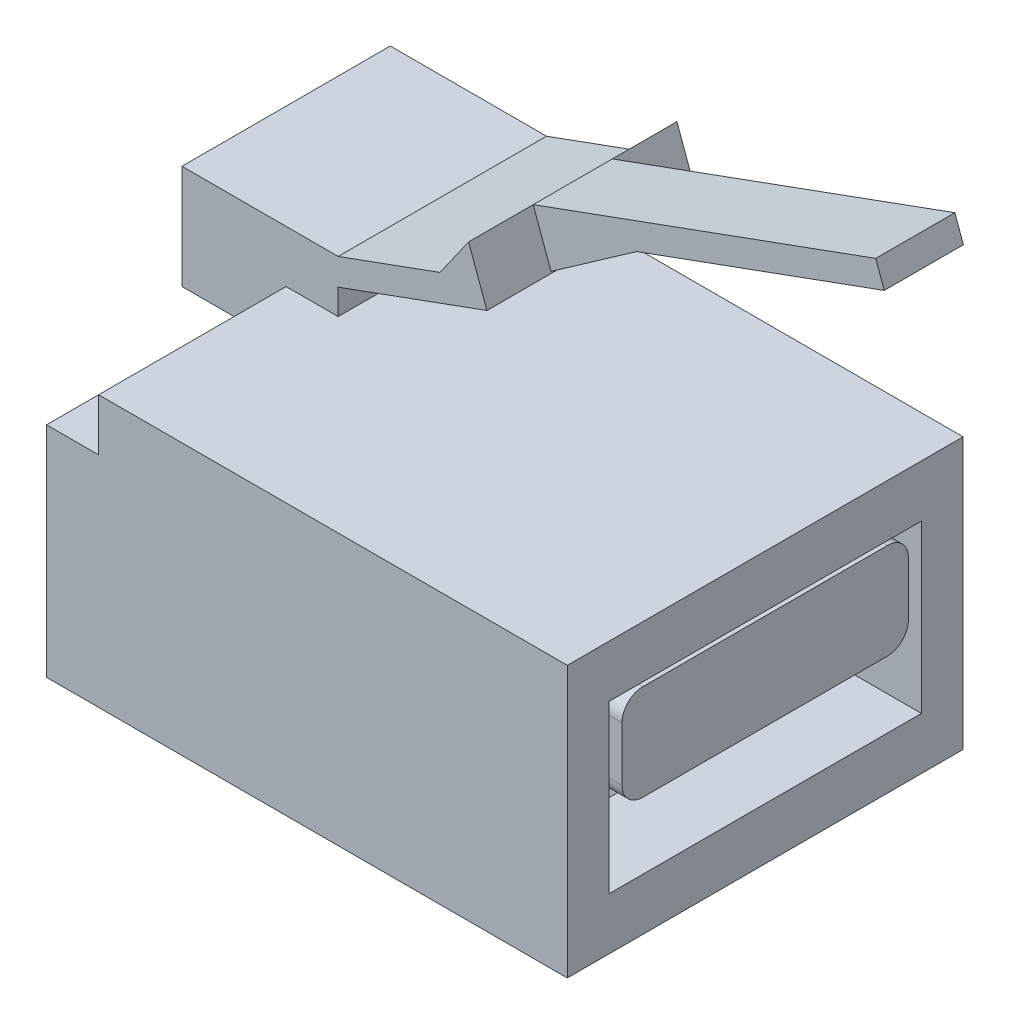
from build123d import *
from build123d.topology import SkipClean

# Parameters (mm, degrees)
SKETCH1_W           = 9.5
SKETCH1_H           = 6.5
EXTRUDE1_DEPTH      = 12.5
EXTRUDE2_DEPTH      = 1.25
EXTRUDE2_DEPTH_BACK = 2.5
SKETCH2_W           = 5
SKETCH2_H           = 2.5
CUT_EXTRUDE1_DEPTH  = 1.25
SKETCH4_W           = 4.5
SKETCH4_H           = 1.25
CUT_EXTRUDE3_DEPTH  = 1.25
CUT_EXTRUDE4_DEPTH  = 3.75
SKETCH8_W           = 7.5
SKETCH8_H           = 4
CUT_EXTRUDE5_DEPTH  = 6.25
EXTRUDE3_DEPTH      = 6.25
EXTRUDE4_DEPTH      = 6.25
SKETCH15_R          = 0.420384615
CUT_EXTRUDE7_DEPTH  = 5.968232
SKETCH18_W          = 4.317612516
SKETCH18_H          = 3.271423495
CUT_EXTRUDE9_DEPTH  = 5.288462
EXTRUDE7_DEPTH      = 0.460769
EXTRUDE7_DEPTH_BACK = 4.787692
EXTRUDE12_DEPTH     = 5
SKETCH25_W          = 1.9
SKETCH25_H          = 0.6
EXTRUDE13_DEPTH     = 8.75
CHAMFER4_SIZE       = 0.65
CHAMFER4_SIZE2      = 2.425833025


with BuildPart() as part:
    # Sketch1 → Extrude1 (new body)
    with BuildSketch(Plane(origin=(0, 0, 0), x_dir=(0, 0, -1), z_dir=(1, 0, 0))):
        with Locations((4.75, 3.25)):
            Rectangle(SKETCH1_W, SKETCH1_H)
    extrude(amount=EXTRUDE1_DEPTH)

    # Sketch2 → Extrude2 (add, two sides: drawn at the far end of the back side and taken through both)
    with BuildSketch(Plane.ZY.offset(-EXTRUDE2_DEPTH_BACK)):
        with Locations((-7, 6.5)):
            Rectangle(SKETCH2_W, SKETCH2_H)
    extrude(amount=EXTRUDE2_DEPTH + EXTRUDE2_DEPTH_BACK)

    # Sketch3 → Cut-Extrude1 (cut)
    with BuildSketch(Plane.ZY):
        Polygon((-7.394230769, 0), (-7.394230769, 2.5), (-6.913461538, 2.5), (-6.913461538, 0), (-6.432692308, 0), (-6.432692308, 2.5), (-5.951923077, 2.5), (-5.951923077, 0), (-5.471153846, 0), (-5.471153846, 2.5), (-4.990384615, 2.5), (-4.990384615, 0), (-4.509615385, 0), (-4.509615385, 2.5), (-4.028846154, 2.5), (-4.028846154, 0), (-3.548076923, 0), (-3.548076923, 2.5), (-3.067307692, 2.5), (-3.067307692, 0), (-2.586538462, 0), (-2.586538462, 2.5), (-2.105769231, 2.5), (-2.105769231, 0), (-2.105769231, -1.077857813), (-7.394230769, -1.077857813), align=None)
    extrude(amount=-CUT_EXTRUDE1_DEPTH, mode=Mode.SUBTRACT)

    # Sketch4 → Cut-Extrude3 (cut)
    with BuildSketch(Plane.ZY):
        with Locations((-2.25, 5.875)):
            Rectangle(SKETCH4_W, SKETCH4_H)
    extrude(amount=-CUT_EXTRUDE3_DEPTH, mode=Mode.SUBTRACT)

    # Sketch5 → Cut-Extrude4 (cut)
    with BuildSketch(Plane.ZY.offset(-1.25)):
        Polygon((-2.105769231, 1), (-2.105769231, -1.077857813), (-7.394230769, -1.077857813), (-7.394230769, 1), (-6.913461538, 1), (-6.913461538, 0), (-6.432692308, 0), (-6.432692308, 1), (-5.951923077, 1), (-5.951923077, 0), (-5.471153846, 0), (-5.471153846, 1), (-4.990384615, 1), (-4.990384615, 0), (-4.509615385, 0), (-4.509615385, 1), (-4.028846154, 1), (-4.028846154, 0), (-3.548076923, 0), (-3.548076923, 1), (-3.067307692, 1), (-3.067307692, 0), (-2.586538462, 0), (-2.586538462, 1), align=None)
    extrude(amount=-CUT_EXTRUDE4_DEPTH, mode=Mode.SUBTRACT)

    # Sketch8 → Cut-Extrude5 (cut)
    with BuildSketch(Plane(origin=(12.5, 0, 0), x_dir=(0, 0, -1), z_dir=(1, 0, 0))):
        with Locations((4.75, 3.25)):
            Rectangle(SKETCH8_W, SKETCH8_H)
    extrude(amount=-CUT_EXTRUDE5_DEPTH, mode=Mode.SUBTRACT)

    # Sketch11 → Extrude3 (add)
    with BuildSketch(Plane(origin=(0, 0, -1.625), x_dir=(-1, 0, 0), z_dir=(0, 0, -1))):
        Polygon((-6.25, 1.25), (-8.375, 3.75), (-10.5, 1.25), align=None)
    extrude(amount=EXTRUDE3_DEPTH)

    # Sketch14 → Extrude4 (add)
    with BuildSketch(Plane(origin=(6.25, 0, 0), x_dir=(0, 0, -1), z_dir=(1, 0, 0))):
        with BuildLine():
            Line((1.8125, 5.15), (7.6875, 5.15))
            ThreePointArc((7.6875, 5.15), (8.041053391, 5.003553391), (8.1875, 4.65))
            Line((8.1875, 4.65), (8.1875, 3.35))
            ThreePointArc((8.1875, 3.35), (8.041053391, 2.996446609), (7.6875, 2.85))
            Line((7.6875, 2.85), (1.8125, 2.85))
            ThreePointArc((1.8125, 2.85), (1.458946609, 2.996446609), (1.3125, 3.35))
            Line((1.3125, 3.35), (1.3125, 4.65))
            ThreePointArc((1.3125, 4.65), (1.458946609, 5.003553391), (1.8125, 5.15))
        make_face()
    extrude(amount=EXTRUDE4_DEPTH)

    # Sketch15 → Cut-Extrude7 (cut)
    with BuildSketch(Plane(origin=(6.25, 0, 0), x_dir=(0, 0, -1), z_dir=(1, 0, 0))):
        with Locations(Location((7.153846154, 4, 0), (0, 0, 180))):
            Circle(SKETCH15_R)
        with Locations(Location((6.192307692, 4, 0), (0, 0, 180))):
            Circle(SKETCH15_R)
        with Locations(Location((5.230769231, 4, 0), (0, 0, 180))):
            Circle(SKETCH15_R)
        with Locations(Location((4.269230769, 4, 0), (0, 0, 180))):
            Circle(SKETCH15_R)
        with Locations(Location((3.307692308, 4, 0), (0, 0, 180))):
            Circle(SKETCH15_R)
        with Locations(Location((2.346153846, 4, 0), (0, 0, 180))):
            Circle(SKETCH15_R)
    extrude(amount=-CUT_EXTRUDE7_DEPTH, mode=Mode.SUBTRACT)

    # Sketch18 → Cut-Extrude9 (cut)
    with SkipClean():  # the faces are left unmerged after this step: merging them gives an invalid solid
        with BuildSketch(Plane(origin=(0, 0, -2.105769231), x_dir=(-1, 0, 0), z_dir=(0, 0, -1))):
            with Locations((-2.621301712, 1.933903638)):
                Rectangle(SKETCH18_W, SKETCH18_H)
        extrude(amount=CUT_EXTRUDE9_DEPTH, mode=Mode.SUBTRACT)

    # Sketch17 → Extrude7 (add, two sides: drawn at the far end of the back side and taken through both)
    with SkipClean():  # the faces are left unmerged after this step: merging them gives an invalid solid
        with BuildSketch(Plane.XY.offset(-2.586538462).offset(-EXTRUDE7_DEPTH_BACK)):
            with BuildLine():
                Line((1.513212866, 3.579615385), (1.513212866, 2.895218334))
                Line((1.513212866, 2.895218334), (1.858886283, 2.895218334))
                ThreePointArc((1.858886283, 2.895218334), (1.952684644, 2.668769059), (1.858886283, 2.442319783))
                Line((1.858886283, 2.442319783), (1.25, 2.442319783))
                Line((1.25, 2.442319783), (1.25, 1))
                Line((1.25, 1), (0.74133089, 1))
                Line((0.74133089, 1), (0.74133089, 0.17187164))
                Line((0.74133089, 0.17187164), (0.844589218, 0.102862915))
                Line((0.844589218, 0.102862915), (4.398014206, 0.102862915))
                Line((4.398014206, 0.102862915), (4.501272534, 0.17187164))
                Line((4.501272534, 0.17187164), (4.501272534, 1))
                Line((4.501272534, 1), (3.992603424, 1))
                Line((3.992603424, 1), (3.992603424, 2.442319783))
                Line((3.992603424, 2.442319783), (3.383717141, 2.442319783))
                ThreePointArc((3.383717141, 2.442319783), (3.28991878, 2.668769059), (3.383717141, 2.895218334))
                Line((3.383717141, 2.895218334), (3.729390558, 2.895218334))
                Line((3.729390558, 2.895218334), (3.729390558, 3.579615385))
                Line((3.729390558, 3.579615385), (1.513212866, 3.579615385))
            make_face()
        extrude(amount=EXTRUDE7_DEPTH + EXTRUDE7_DEPTH_BACK)

    # Sketch24 → Extrude12 (add)
    with SkipClean():  # the faces are left unmerged after this step: merging them gives an invalid solid
        with BuildSketch(Plane.XY.offset(-4.5)):
            Polygon((2.5, 7.75), (4.943120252, 8.639473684), (5.631347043, 9.618283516), (6.070714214, 8.411472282), (2.5, 7.111472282), align=None)
        extrude(amount=-EXTRUDE12_DEPTH)

    # Sketch25 → Extrude13 (add)
    with SkipClean():  # the faces are left unmerged after this step: merging them gives an invalid solid
        with BuildSketch(Plane(origin=(8.064200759, 2.935956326, 0), x_dir=(0, 0, -1), z_dir=(0.9396616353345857, 0.3421052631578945, 0))):
            with Locations((7, 6.811418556)):
                Rectangle(SKETCH25_W, SKETCH25_H)
        extrude(amount=EXTRUDE13_DEPTH)

    # Chamfer4
    chamfer4_edges = [part.edges().sort_by_distance(p)[0] for p in [
        (5.836610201, 9.054486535, -7),
    ]]
    chamfer4_side = [part.faces().sort_by_distance(p)[0] for p in [
        (5.876295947, 8.945481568, -7),
    ]]
    chamfer(chamfer4_edges, length=CHAMFER4_SIZE, length2=CHAMFER4_SIZE2, reference=chamfer4_side[0])


solid = part.part
